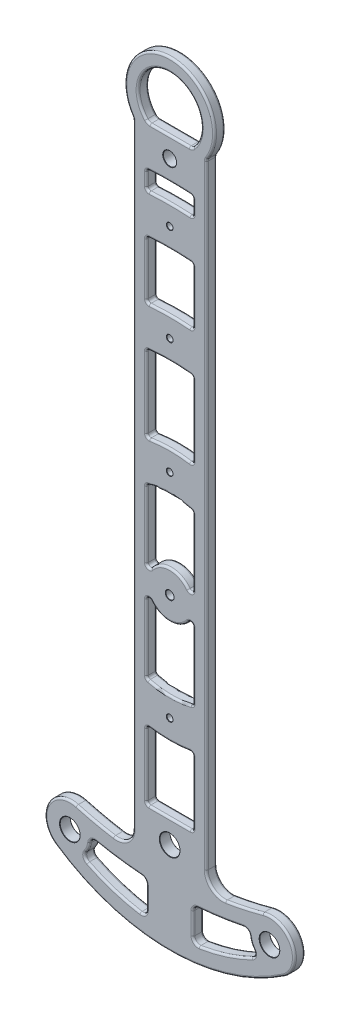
from build123d import *

# Parameters (mm, degrees)
SKETCH_1_R      = 4.55
SKETCH_1_R_2    = 6.1
SKETCH_1_R_3    = 15
SKETCH_1_R_4    = 10
EXTRUDE_1_DEPTH = 16
FILLET_1_R      = 3
CHAMFER_1_SIZE  = 0.5


with BuildPart() as part:
    # Sketch 1 → Extrude 1 (new body)
    with BuildSketch(Plane.XY):
        with BuildLine():
            Line((-55, 430.891707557), (-55, -491.481640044))
            ThreePointArc((-55, -491.481640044), (-63.804501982, -510.526477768), (-84.016467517, -516.156890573))
            ThreePointArc((-84.016467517, -516.156890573), (-112.158526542, -510.780938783), (-139.963926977, -503.871810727))
            ThreePointArc((-139.963926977, -503.871810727), (-184.01084004, -524.210619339), (-171.123874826, -570.983729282))
            ThreePointArc((-171.123874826, -570.983729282), (0, -623.77), (171.123874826, -570.983729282))
            ThreePointArc((171.123874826, -570.983729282), (184.01084004, -524.210619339), (139.963926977, -503.871810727))
            ThreePointArc((139.963926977, -503.871810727), (112.158526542, -510.780938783), (84.016467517, -516.156890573))
            ThreePointArc((84.016467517, -516.156890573), (63.804501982, -510.526477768), (55, -491.481640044))
            Line((55, -491.481640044), (55, 430.891707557))
            ThreePointArc((55, 430.891707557), (55.338277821, 433.193448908), (56.324503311, 435.300533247))
            ThreePointArc((56.324503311, 435.300533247), (0, 540), (-56.324503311, 435.300533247))
            ThreePointArc((-56.324503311, 435.300533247), (-55.338277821, 433.193448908), (-55, 430.891707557))
        make_face()
        Circle(SKETCH_1_R, mode=Mode.SUBTRACT)
        with Locations((0, 174)):
            Circle(SKETCH_1_R, mode=Mode.SUBTRACT)
        with Locations((0, 320)):
            Circle(SKETCH_1_R, mode=Mode.SUBTRACT)
        with Locations((0, -160)):
            Circle(SKETCH_1_R_2, mode=Mode.SUBTRACT)
        with Locations((0, -320)):
            Circle(SKETCH_1_R, mode=Mode.SUBTRACT)
        with Locations((0, -485)):
            Circle(SKETCH_1_R_3, mode=Mode.SUBTRACT)
        with Locations((0, 408)):
            Circle(SKETCH_1_R_4, mode=Mode.SUBTRACT)
        with Locations((-150, -540.001793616)):
            Circle(SKETCH_1_R_3, mode=Mode.SUBTRACT)
        with Locations(Location((150, -540.001793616, 0), (0, 0, 180))):
            Circle(SKETCH_1_R_3, mode=Mode.SUBTRACT)
        with BuildLine():
            Line((-29.506989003, 438.24), (29.506989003, 438.24))
            ThreePointArc((29.506989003, 438.24), (32.782057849, 438.941101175), (35.483088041, 440.921518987))
            ThreePointArc((35.483088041, 440.921518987), (0, 520), (-35.483088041, 440.921518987))
            ThreePointArc((-35.483088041, 440.921518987), (-32.782057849, 438.941101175), (-29.506989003, 438.24))
        make_face(mode=Mode.SUBTRACT)
        with BuildLine():
            Line((-35, -554.284586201), (-35, -587.333860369))
            ThreePointArc((-35, -587.333860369), (-37.811725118, -593.423343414), (-44.270450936, -595.232338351))
            ThreePointArc((-44.270450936, -595.232338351), (-84.676715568, -585.598506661), (-123.202879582, -570.067517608))
            ThreePointArc((-123.202879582, -570.067517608), (-127.450556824, -564.740634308), (-126.053104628, -558.072383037))
            ThreePointArc((-126.053104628, -558.072383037), (-122.16801291, -551.19913681), (-120.2106095, -543.550344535))
            ThreePointArc((-120.2106095, -543.550344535), (-116.943976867, -538.006343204), (-110.651277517, -536.661436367))
            ThreePointArc((-110.651277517, -536.661436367), (-76.668145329, -542.559856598), (-42.38123932, -546.308551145))
            ThreePointArc((-42.38123932, -546.308551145), (-37.128454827, -548.850898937), (-35, -554.284586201))
        make_face(mode=Mode.SUBTRACT)
        with BuildLine():
            Line((35, -554.284586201), (35, -587.333860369))
            ThreePointArc((35, -587.333860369), (37.811725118, -593.423343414), (44.270450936, -595.232338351))
            ThreePointArc((44.270450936, -595.232338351), (84.676715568, -585.598506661), (123.202879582, -570.067517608))
            ThreePointArc((123.202879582, -570.067517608), (127.450556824, -564.740634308), (126.053104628, -558.072383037))
            ThreePointArc((126.053104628, -558.072383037), (122.16801291, -551.19913681), (120.2106095, -543.550344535))
            ThreePointArc((120.2106095, -543.550344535), (116.943976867, -538.006343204), (110.651277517, -536.661436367))
            ThreePointArc((110.651277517, -536.661436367), (76.668145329, -542.559856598), (42.38123932, -546.308551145))
            ThreePointArc((42.38123932, -546.308551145), (37.128454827, -548.850898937), (35, -554.284586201))
        make_face(mode=Mode.SUBTRACT)
        with BuildLine():
            Line((-31, -450), (31, -450))
            ThreePointArc((31, -450), (33.828427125, -448.828427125), (35, -446))
            Line((35, -446), (35, -352.114965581))
            ThreePointArc((35, -352.114965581), (33.593374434, -349.069574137), (30.362795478, -348.166045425))
            ThreePointArc((30.362795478, -348.166045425), (0, -350.6), (-30.362795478, -348.166045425))
            ThreePointArc((-30.362795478, -348.166045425), (-33.593374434, -349.069574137), (-35, -352.114965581))
            Line((-35, -352.114965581), (-35, -446))
            ThreePointArc((-35, -446), (-33.828427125, -448.828427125), (-31, -450))
        make_face(mode=Mode.SUBTRACT)
        with BuildLine():
            Line((35, -36.738448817), (35, -136.335680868))
            ThreePointArc((35, -136.335680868), (32.28102523, -140.125004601), (27.820512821, -138.762790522))
            ThreePointArc((27.820512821, -138.762790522), (0, -125), (-27.820512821, -138.762790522))
            ThreePointArc((-27.820512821, -138.762790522), (-32.28102523, -140.125004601), (-35, -136.335680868))
            Line((-35, -136.335680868), (-35, -36.738448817))
            ThreePointArc((-35, -36.738448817), (-34.154555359, -34.279021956), (-31.975609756, -32.859249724))
            ThreePointArc((-31.975609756, -32.859249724), (0, -28.9), (31.975609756, -32.859249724))
            ThreePointArc((31.975609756, -32.859249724), (34.154555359, -34.279021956), (35, -36.738448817))
        make_face(mode=Mode.SUBTRACT)
        with BuildLine():
            Line((-35, 32.114965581), (-35, 138.896721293))
            ThreePointArc((-35, 138.896721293), (-33.970739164, 141.575285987), (-31.412645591, 142.875379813))
            ThreePointArc((-31.412645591, 142.875379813), (0, 144.5), (31.412645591, 142.875379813))
            ThreePointArc((31.412645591, 142.875379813), (33.970739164, 141.575285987), (35, 138.896721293))
            Line((35, 138.896721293), (35, 32.114965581))
            ThreePointArc((35, 32.114965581), (33.593374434, 29.069574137), (30.362795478, 28.166045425))
            ThreePointArc((30.362795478, 28.166045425), (0, 30.6), (-30.362795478, 28.166045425))
            ThreePointArc((-30.362795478, 28.166045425), (-33.593374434, 29.069574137), (-35, 32.114965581))
        make_face(mode=Mode.SUBTRACT)
        with BuildLine():
            Line((-35, -183.664319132), (-35, -283.261551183))
            ThreePointArc((-35, -283.261551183), (-34.154555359, -285.720978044), (-31.975609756, -287.140750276))
            ThreePointArc((-31.975609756, -287.140750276), (0, -291.1), (31.975609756, -287.140750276))
            ThreePointArc((31.975609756, -287.140750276), (34.154555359, -285.720978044), (35, -283.261551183))
            Line((35, -283.261551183), (35, -183.664319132))
            ThreePointArc((35, -183.664319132), (32.28102523, -179.874995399), (27.820512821, -181.237209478))
            ThreePointArc((27.820512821, -181.237209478), (0, -195), (-27.820512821, -181.237209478))
            ThreePointArc((-27.820512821, -181.237209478), (-32.28102523, -179.874995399), (-35, -183.664319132))
        make_face(mode=Mode.SUBTRACT)
        with BuildLine():
            Line((-35, 207.118483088), (-35, 285.247128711))
            ThreePointArc((-35, 285.247128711), (-33.925004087, 287.975562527), (-31.277824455, 289.237468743))
            ThreePointArc((-31.277824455, 289.237468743), (0, 290.325), (31.277824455, 289.237468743))
            ThreePointArc((31.277824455, 289.237468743), (33.925004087, 287.975562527), (35, 285.247128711))
            Line((35, 285.247128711), (35, 207.118483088))
            ThreePointArc((35, 207.118483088), (33.706818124, 204.173464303), (30.663432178, 203.132667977))
            ThreePointArc((30.663432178, 203.132667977), (0, 204.425), (-30.663432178, 203.132667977))
            ThreePointArc((-30.663432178, 203.132667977), (-33.706818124, 204.173464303), (-35, 207.118483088))
        make_face(mode=Mode.SUBTRACT)
        with BuildLine():
            Line((-35, 353.314779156), (-35, 372.849005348))
            ThreePointArc((-35, 372.849005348), (-33.909404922, 375.594066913), (-31.232318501, 376.842253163))
            ThreePointArc((-31.232318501, 376.842253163), (0, 377.75), (31.232318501, 376.842253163))
            ThreePointArc((31.232318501, 376.842253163), (33.909404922, 375.594066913), (35, 372.849005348))
            Line((35, 372.849005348), (35, 353.314779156))
            ThreePointArc((35, 353.314779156), (33.741850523, 350.402347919), (30.758872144, 349.322053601))
            ThreePointArc((30.758872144, 349.322053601), (0, 350.25), (-30.758872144, 349.322053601))
            ThreePointArc((-30.758872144, 349.322053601), (-33.741850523, 350.402347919), (-35, 353.314779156))
        make_face(mode=Mode.SUBTRACT)
    extrude(amount=EXTRUDE_1_DEPTH)

    # Fillet 1
    fillet_1_edges = [part.edges().sort_by_distance(p)[0] for p in [
        (-33.741850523, 350.402347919, 0),
        (0, 377.75, 0),
        (35, 363.081892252, 0),
        (-35, 246.182805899, 0),
        (-33.925004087, 287.975562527, 0),
        (0, 290.325, 0),
        (33.925004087, 287.975562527, 0),
        (35, 246.182805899, 0),
        (33.706818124, 204.173464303, 0),
        (-33.593374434, 29.069574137, 0),
        (-35, 85.505843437, 0),
        (-33.970739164, 141.575285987, 0),
        (0, 144.5, 0),
        (35, 85.505843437, 0),
        (33.593374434, 29.069574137, 0),
        (-32.28102523, -140.125004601, 0),
        (-34.154555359, -34.279021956, 0),
        (0, -28.9, 0),
        (34.154555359, -34.279021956, 0),
        (35, -86.537064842, 0),
        (-35, -233.462935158, 0),
        (-32.28102523, -179.874995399, 0),
        (32.28102523, -179.874995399, 0),
        (35, -233.462935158, 0),
        (34.154555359, -285.720978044, 0),
        (-33.828427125, -448.828427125, 0),
        (-35, -399.05748279, 0),
        (0, -350.6, 0),
        (33.593374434, -349.069574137, 0),
        (35, -399.05748279, 0),
        (33.828427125, -448.828427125, 0),
        (-55, -30.294966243, 0),
        (-63.804501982, -510.526477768, 0),
        (-112.158526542, -510.780938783, 0),
        (-184.01084004, -524.210619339, 0),
        (0, -623.77, 0),
        (184.01084004, -524.210619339, 0),
        (112.158526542, -510.780938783, 0),
        (-37.811725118, -593.423343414, 0),
        (-84.676715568, -585.598506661, 0),
        (-127.450556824, -564.740634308, 0),
        (-122.16801291, -551.19913681, 0),
        (-76.668145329, -542.559856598, 0),
        (-37.128454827, -548.850898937, 0),
        (37.128454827, -548.850898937, 0),
        (76.668145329, -542.559856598, 0),
        (116.943976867, -538.006343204, 0),
        (122.16801291, -551.19913681, 0),
        (127.450556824, -564.740634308, 0),
        (84.676715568, -585.598506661, 0),
        (84.676715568, -585.598506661, 16),
        (37.811725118, -593.423343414, 16),
        (37.128454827, -548.850898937, 16),
        (-37.128454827, -548.850898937, 16),
        (-35, -570.809223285, 16),
        (-37.811725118, -593.423343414, 16),
        (-84.676715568, -585.598506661, 16),
        (-127.450556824, -564.740634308, 16),
        (-122.16801291, -551.19913681, 16),
        (-116.943976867, -538.006343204, 16),
        (35, -399.05748279, 16),
        (33.828427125, -448.828427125, 16),
        (0, -450, 16),
        (-33.828427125, -448.828427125, 16),
        (32.28102523, -179.874995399, 16),
        (35, -233.462935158, 16),
        (34.154555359, -285.720978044, 16),
        (-32.28102523, -179.874995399, 16),
        (32.28102523, -140.125004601, 16),
        (-32.28102523, -140.125004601, 16),
        (33.970739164, 141.575285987, 16),
        (35, 85.505843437, 16),
        (33.593374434, 29.069574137, 16),
        (0, 30.6, 16),
        (-33.593374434, 29.069574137, 16),
        (-33.970739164, 141.575285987, 16),
        (35, 246.182805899, 16),
        (33.706818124, 204.173464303, 16),
        (-33.706818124, 204.173464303, 16),
        (-35, 246.182805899, 16),
        (33.909404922, 375.594066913, 16),
        (35, 363.081892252, 16),
        (0, 350.25, 16),
        (-33.741850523, 350.402347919, 16),
        (-35, 363.081892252, 16),
        (-63.804501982, -510.526477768, 16),
        (-112.158526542, -510.780938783, 16),
        (-184.01084004, -524.210619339, 16),
        (0, -623.77, 16),
        (184.01084004, -524.210619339, 16),
        (112.158526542, -510.780938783, 16),
        (63.804501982, -510.526477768, 16),
        (0, 520, 0),
        (0, 438.24, 0),
        (0, 350.25, 0),
        (0, 30.6, 0),
        (0, -125, 0),
        (0, -291.1, 0),
        (0, -450, 0),
        (55, -30.294966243, 0),
        (-35, -570.809223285, 0),
        (35, -570.809223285, 0),
        (-76.668145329, -542.559856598, 16),
        (0, -350.6, 16),
        (0, -195, 16),
        (0, -28.9, 16),
        (0, 144.5, 16),
        (0, 377.75, 16),
        (0, 520, 16),
        (0, 438.24, 16),
        (55, -30.294966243, 16),
        (-32.782057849, 438.941101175, 0),
        (32.782057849, 438.941101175, 0),
        (-32.782057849, 438.941101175, 16),
        (32.782057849, 438.941101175, 16),
        (-55.338277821, 433.193448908, 0),
        (0, 540, 0),
        (55.338277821, 433.193448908, 0),
        (-55.338277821, 433.193448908, 16),
        (55.338277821, 433.193448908, 16),
    ]]
    fillet(fillet_1_edges, radius=FILLET_1_R)

    # Chamfer 1
    chamfer_1_edges = [part.edges().sort_by_distance(p)[0] for p in [
        (-4.55, 0, 0),
        (-4.55, 0, 16),
        (-4.55, 174, 0),
        (-4.55, 174, 16),
        (-4.55, 320, 0),
        (-4.55, 320, 16),
        (-6.1, -160, 0),
        (-6.1, -160, 16),
        (-4.55, -320, 0),
        (-4.55, -320, 16),
        (-15, -485, 0),
        (-15, -485, 16),
        (-10, 408, 0),
        (-10, 408, 16),
        (-165, -540.001793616, 0),
        (-165, -540.001793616, 16),
        (165, -540.001793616, 0),
        (165, -540.001793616, 16),
    ]]
    chamfer(chamfer_1_edges, length=CHAMFER_1_SIZE)


solid = part.part
